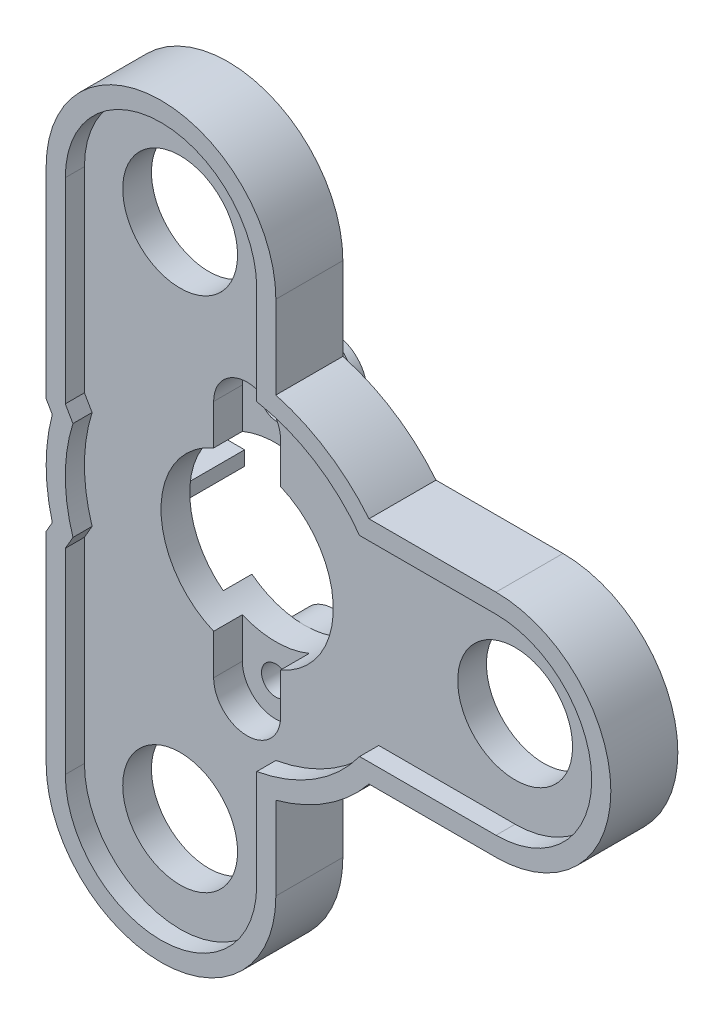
from build123d import *
from build123d.topology import SkipClean

# Parameters (mm, degrees)
ESQUISSE1_R                  = 9
ESQUISSE1_R_2                = 6
EXTRUSION1_DEPTH             = 3.5
ENL_V_MAT_EXTRU_1_DEPTH      = 2
ENL_V_START                  = -2
ESQUISSE4_R                  = 17
ENL_V_MAT_EXTRU_2_DEPTH      = 2
ESQUISSE6_W                  = 7.877170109
ESQUISSE6_H                  = 1.5
EXTRUSION4_DEPTH             = 6
R_P_TITION_CIRCULAIRE1_COUNT = 2
EXTRUSION5_START             = 3
EXTRUSION5_DEPTH             = 3
ENL_V_MAT_EXTRU_3_DEPTH      = 3
ESQUISSE10_R                 = 3.5
EXTRUSION6_DEPTH             = 3
ESQUISSE11_R                 = 1.5
ENL_V_MAT_EXTRU_4_DEPTH      = 57.938563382


with BuildPart() as part:
    # Esquisse1 → Extrusion1 (new, symmetric)
    with BuildSketch(Plane.XY):
        with BuildLine():
            Line((28, 12), (14.730919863, 12))
            ThreePointArc((14.730919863, 12), (10.360766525, 15.926534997), (5, 18.33030278))
            Line((5, 18.33030278), (5, 27))
            ThreePointArc((5, 27), (-7, 39), (-19, 27))
            Line((-19, 27), (-19, 6))
            Line((-19, 6), (-18.35969719, 4.890963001))
            ThreePointArc((-18.35969719, 4.890963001), (-19, 0), (-18.35969719, -4.890963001))
            Line((-18.35969719, -4.890963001), (-19, -6))
            Line((-19, -6), (-19, -27))
            ThreePointArc((-19, -27), (-7, -39), (5, -27))
            Line((5, -27), (5, -18.33030278))
            ThreePointArc((5, -18.33030278), (10.360766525, -15.926534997), (14.730919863, -12))
            Line((14.730919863, -12), (28, -12))
            ThreePointArc((28, -12), (40, 0), (28, 12))
        make_face()
        with Locations(Location((0, 0, 0), (0, 0, 127.669886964))):
            Circle(ESQUISSE1_R, mode=Mode.SUBTRACT)
        with Locations(Location((-7, -27, 0), (0, 0, 180))):
            Circle(ESQUISSE1_R_2, mode=Mode.SUBTRACT)
        with Locations((-7, 27)):
            Circle(ESQUISSE1_R_2, mode=Mode.SUBTRACT)
        with Locations((28, 0)):
            Circle(ESQUISSE1_R_2, mode=Mode.SUBTRACT)
    extrude(amount=EXTRUSION1_DEPTH, both=True)

    # Esquisse3 → Enl_v. mat.-Extru.1 (cut)
    with BuildSketch(Plane.XY.offset(3.5)):
        with BuildLine():
            Line((-16.200693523, -5.151458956), (-17, -6.535898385))
            Line((-17, -6.535898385), (-17, -27))
            ThreePointArc((-17, -27), (-7, -37), (3, -27))
            Line((3, -27), (3, -16.733200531))
            ThreePointArc((3, -16.733200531), (9.025274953, -14.406401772), (13.747727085, -10))
            Line((13.747727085, -10), (28, -10))
            ThreePointArc((28, -10), (38, 0), (28, 10))
            Line((28, 10), (13.747727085, 10))
            ThreePointArc((13.747727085, 10), (9.025274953, 14.406401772), (3, 16.733200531))
            Line((3, 16.733200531), (3, 27))
            ThreePointArc((3, 27), (-7, 37), (-17, 27))
            Line((-17, 27), (-17, 6.535898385))
            Line((-17, 6.535898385), (-16.200693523, 5.151458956))
            ThreePointArc((-16.200693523, 5.151458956), (-17, 0), (-16.200693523, -5.151458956))
        make_face()
    extrude(amount=-ENL_V_MAT_EXTRU_1_DEPTH, mode=Mode.SUBTRACT)

    # Esquisse4 → Enl_v. mat.-Extru.2 (cut)
    with BuildSketch(Plane(origin=(0, 0, -3.5), x_dir=(-1, 0, 0), z_dir=(0, 0, -1)).offset(ENL_V_START)):
        Circle(ESQUISSE4_R)
        with BuildLine():
            Line((17, 12), (17, 27))
            ThreePointArc((17, 27), (7, 37), (-3, 27))
            Line((-3, 27), (-3, 19.899748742))
            ThreePointArc((-3, 19.899748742), (-2.670820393, 19.158128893), (-1.9, 18.904761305))
            ThreePointArc((-1.9, 18.904761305), (7.635630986, 17.398193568), (15.2, 11.4))
            ThreePointArc((15.2, 11.4), (16.316227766, 11.051316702), (17, 12))
        make_face()
        with BuildLine():
            Line((-17.860571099, 10), (-28, 10))
            ThreePointArc((-28, 10), (-38, 0), (-28, -10))
            Line((-28, -10), (-17.860571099, -10))
            ThreePointArc((-17.860571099, -10), (-17.009101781, -9.524404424), (-16.967542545, -8.55))
            ThreePointArc((-16.967542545, -8.55), (-19, 0), (-16.967542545, 8.55))
            ThreePointArc((-16.967542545, 8.55), (-17.009101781, 9.524404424), (-17.860571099, 10))
        make_face()
        with BuildLine():
            Line((-3, -19.899748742), (-3, -27))
            ThreePointArc((-3, -27), (7, -37), (17, -27))
            Line((17, -27), (17, -12))
            ThreePointArc((17, -12), (16.316227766, -11.051316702), (15.2, -11.4))
            ThreePointArc((15.2, -11.4), (7.635630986, -17.398193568), (-1.9, -18.904761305))
            ThreePointArc((-1.9, -18.904761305), (-2.670820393, -19.158128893), (-3, -19.899748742))
        make_face()
    extrude(amount=ENL_V_MAT_EXTRU_2_DEPTH, mode=Mode.SUBTRACT)

    # Esquisse6 → Extrusion4 (add)
    with BuildSketch(Plane(origin=(0, 0, -1.5), x_dir=(-1, 0, 0), z_dir=(0, 0, -1))):
        with Locations((13.200835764, 0)):
            Rectangle(ESQUISSE6_W, ESQUISSE6_H)
    extrusion4 = extrude(amount=EXTRUSION4_DEPTH)

    # R_p_tition circulaire1: Extrusion4 ×2 about axis
    r_p_tition_circulaire1_axis = Axis((0, 0, 0), (0, 0, 1))
    for i in range(1, R_P_TITION_CIRCULAIRE1_COUNT):
        add(extrusion4.rotate(r_p_tition_circulaire1_axis, i * 360 / R_P_TITION_CIRCULAIRE1_COUNT))

    # Esquisse7 → Extrusion5 (add)
    with SkipClean():  # the faces are left unmerged after this step: merging them gives an invalid solid
        with BuildSketch(Plane(origin=(0, 0, -1.5), x_dir=(-1, 0, 0), z_dir=(0, 0, -1)).offset(EXTRUSION5_START)):
            with BuildLine():
                Line((5.5, 14), (5.5, 7.123903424))
                ThreePointArc((5.5, 7.123903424), (0, 9), (-5.5, 7.123903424))
                Line((-5.5, 7.123903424), (-5.5, 14))
                ThreePointArc((-5.5, 14), (0, 19.5), (5.5, 14))
            make_face()
            with BuildLine():
                Line((-5.5, -14), (-5.5, -7.123903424))
                ThreePointArc((-5.5, -7.123903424), (0, -9), (5.5, -7.123903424))
                Line((5.5, -7.123903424), (5.5, -14))
                ThreePointArc((5.5, -14), (0, -19.5), (-5.5, -14))
            make_face()
        extrude(amount=-EXTRUSION5_DEPTH)

    # Esquisse8 → Enl_v. mat.-Extru.3 (cut)
    with SkipClean():  # the faces are left unmerged after this step: merging them gives an invalid solid
        with BuildSketch(Plane.XY.offset(1.5)):
            with BuildLine():
                Line((3.5, 12.5), (3.5, -12.5))
                ThreePointArc((3.5, -12.5), (0, -16), (-3.5, -12.5))
                Line((-3.5, -12.5), (-3.5, 12.5))
                ThreePointArc((-3.5, 12.5), (0, 16), (3.5, 12.5))
            make_face()
        extrude(amount=-ENL_V_MAT_EXTRU_3_DEPTH, mode=Mode.SUBTRACT)

    # Esquisse10 → Extrusion6 (add)
    with SkipClean():  # the faces are left unmerged after this step: merging them gives an invalid solid
        with BuildSketch(Plane(origin=(0, 0, -4.5), x_dir=(-1, 0, 0), z_dir=(0, 0, -1))):
            with Locations(Location((0, 12.5, 0), (0, 0, 270))):
                Circle(ESQUISSE10_R)
            with Locations(Location((0, -12.5, 0), (0, 0, 89.999632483))):
                Circle(ESQUISSE10_R)
        extrude(amount=EXTRUSION6_DEPTH)

    # Esquisse11 → Enl_v. mat.-Extru.4 (cut, through all)
    with SkipClean():  # the faces are left unmerged after this step: merging them gives an invalid solid
        with BuildSketch(Plane(origin=(0, 0, -7.5), x_dir=(-1, 0, 0), z_dir=(0, 0, -1))):
            with Locations((0, -12.5)):
                Circle(ESQUISSE11_R)
            with Locations((0, 12.5)):
                Circle(ESQUISSE11_R)
        extrude(amount=-ENL_V_MAT_EXTRU_4_DEPTH, mode=Mode.SUBTRACT)


solid = part.part
